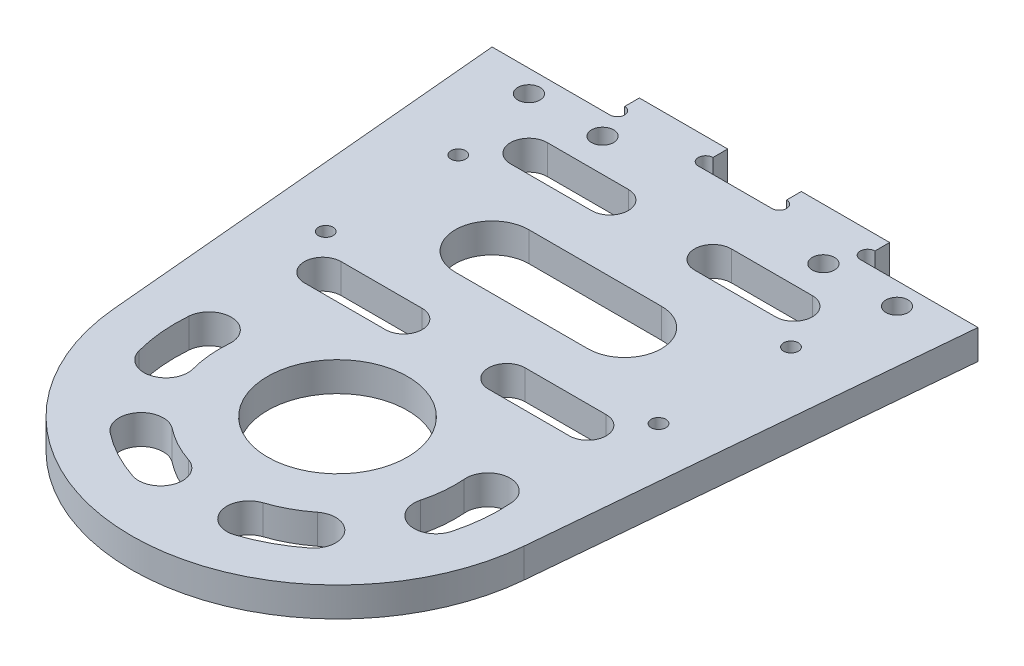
from build123d import *

# Parameters (mm, degrees)
SKETCH1_R           = 28
SKETCH1_R_2         = 13.5
SKETCH1_R_3         = 1.5
BOSS_EXTRUDE1_DEPTH = 4
SKETCH5_R           = 21
CUT_EXTRUDE4_DEPTH  = 10
BOSS_EXTRUDE2_DEPTH = 4
SKETCH7_W           = 12
SKETCH7_H           = 4
BOSS_EXTRUDE3_DEPTH = 4
SKETCH9_R           = 1.5
CUT_EXTRUDE6_DEPTH  = 67.850579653
SKETCH10_R          = 28
BOSS_EXTRUDE4_DEPTH = 4
SKETCH11_R          = 9.5
CUT_EXTRUDE7_DEPTH  = 67.850579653
SKETCH8_R           = 1
CUT_EXTRUDE5_DEPTH  = 67.850579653
CUT_EXTRUDE9_DEPTH  = 67.850579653
CUT_EXTRUDE10_DEPTH = 67.850579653


with BuildPart() as part:
    # Sketch1 → Boss-Extrude1 (new body)
    with BuildSketch(Plane(origin=(0, 0, 0), x_dir=(1, 0, 0), z_dir=(0, 1, 0))):
        with Locations(Location((0, 0, 0), (0, 0, 270))):
            Circle(SKETCH1_R)
        with Locations(Location((0, 0, 0), (0, 0, 270))):
            Circle(SKETCH1_R_2, mode=Mode.SUBTRACT)
        with Locations(Location((0, -17.5, 0), (0, 0, 270))):
            Circle(SKETCH1_R_3, mode=Mode.SUBTRACT)
        with Locations(Location((-17.5, 0, 0), (0, 0, 270))):
            Circle(SKETCH1_R_3, mode=Mode.SUBTRACT)
        with Locations(Location((0, 17.5, 0), (0, 0, 270))):
            Circle(SKETCH1_R_3, mode=Mode.SUBTRACT)
        with Locations(Location((17.5, 0, 0), (0, 0, 270))):
            Circle(SKETCH1_R_3, mode=Mode.SUBTRACT)
        with Locations(Location((0, -25, 0), (0, 0, 270))):
            Circle(SKETCH1_R_3, mode=Mode.SUBTRACT)
        with Locations(Location((-17.67766953, -17.67766953, 0), (0, 0, 270))):
            Circle(SKETCH1_R_3, mode=Mode.SUBTRACT)
        with Locations(Location((-25, 0, 0), (0, 0, 270))):
            Circle(SKETCH1_R_3, mode=Mode.SUBTRACT)
        with Locations(Location((-17.67766953, 17.67766953, 0), (0, 0, 270))):
            Circle(SKETCH1_R_3, mode=Mode.SUBTRACT)
        with Locations(Location((0, 25, 0), (0, 0, 270))):
            Circle(SKETCH1_R_3, mode=Mode.SUBTRACT)
        with Locations(Location((17.67766953, 17.67766953, 0), (0, 0, 270))):
            Circle(SKETCH1_R_3, mode=Mode.SUBTRACT)
        with Locations(Location((25, 0, 0), (0, 0, 270))):
            Circle(SKETCH1_R_3, mode=Mode.SUBTRACT)
        with Locations(Location((17.67766953, -17.67766953, 0), (0, 0, 270))):
            Circle(SKETCH1_R_3, mode=Mode.SUBTRACT)
    extrude(amount=BOSS_EXTRUDE1_DEPTH)

    # Sketch5 → Cut-Extrude4 (cut)
    with BuildSketch(Plane.XZ):
        with Locations(Location((0, 0, 0), (0, 0, 270))):
            Circle(SKETCH5_R)
    extrude(amount=-CUT_EXTRUDE4_DEPTH, mode=Mode.SUBTRACT)



with BuildPart() as body_2:
    # Sketch6 → Boss-Extrude2 (new, through all)
    with BuildSketch(Plane(origin=(0, 4, 0), x_dir=(1, 0, 0), z_dir=(0, 1, 0))):
        with BuildLine():
            ThreePointArc((-27.886099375, -2.522986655), (-20.671763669, 18.885925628), (0, 28))
            Line((0, 28), (0, 54))
            Line((0, 54), (-33, 54))
            Line((-33, 54), (-27.886099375, -2.522986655))
        make_face()
        with BuildLine():
            Line((0, 54), (0, 28))
            ThreePointArc((0, 28), (19.798989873, 19.798989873), (28, 0))
            ThreePointArc((28, 0), (27.97151035, -1.262778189), (27.886099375, -2.522986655))
            Line((27.886099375, -2.522986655), (33, 54))
            Line((33, 54), (0, 54))
        make_face()
    extrude(amount=-BOSS_EXTRUDE2_DEPTH)

    # Sketch7 → Boss-Extrude3 (add, through all)
    with BuildSketch(Plane(origin=(0, 4, 0), x_dir=(1, 0, 0), z_dir=(0, 1, 0))):
        with Locations((-11, 56)):
            Rectangle(SKETCH7_W, SKETCH7_H)
        with Locations((11, 56)):
            Rectangle(SKETCH7_W, SKETCH7_H)
    extrude(amount=-BOSS_EXTRUDE3_DEPTH)

    # Sketch9 → Cut-Extrude6 (cut, through all)
    with BuildSketch(Plane(origin=(0, 4, 0), x_dir=(1, 0, 0), z_dir=(0, 1, 0))):
        with Locations(Location((-25, 51, 0), (0, 0, 270))):
            Circle(SKETCH9_R)
        with Locations(Location((-15, 51, 0), (0, 0, 270))):
            Circle(SKETCH9_R)
        with Locations(Location((25, 51, 0), (0, 0, 270))):
            Circle(SKETCH9_R)
        with Locations(Location((15, 51, 0), (0, 0, 270))):
            Circle(SKETCH9_R)
    extrude(amount=-CUT_EXTRUDE6_DEPTH, mode=Mode.SUBTRACT)


with BuildPart() as part_1:
    add(part.part)

    add(body_2.part)  # Boss-Extrude4 merges body 2
    # Sketch10 → Boss-Extrude4 (add, through all)
    with BuildSketch(Plane(origin=(0, 4, 0), x_dir=(1, 0, 0), z_dir=(0, 1, 0))):
        Circle(SKETCH10_R)
    extrude(amount=-BOSS_EXTRUDE4_DEPTH)

    # Sketch11 → Cut-Extrude7 (cut, through all)
    with BuildSketch(Plane(origin=(0, 4, 0), x_dir=(1, 0, 0), z_dir=(0, 1, 0))):
        with Locations(Location((0, 0, 0), (0, 0, 270))):
            Circle(SKETCH11_R)
    extrude(amount=-CUT_EXTRUDE7_DEPTH, mode=Mode.SUBTRACT)

    # Sketch8 → Cut-Extrude5 (cut, through all)
    with BuildSketch(Plane(origin=(0, 4, 0), x_dir=(1, 0, 0), z_dir=(0, 1, 0))):
        with Locations((-5, 55)):
            Circle(SKETCH8_R)
        with Locations((5, 55)):
            Circle(SKETCH8_R)
        with Locations((-17, 55)):
            Circle(SKETCH8_R)
        with Locations((17, 55)):
            Circle(SKETCH8_R)
        with Locations(Location((-22.6, 39, 0), (0, 0, 270))):
            Circle(SKETCH8_R)
        with Locations(Location((-22.6, 21, 0), (0, 0, 270))):
            Circle(SKETCH8_R)
        with Locations(Location((22.6, 39, 0), (0, 0, 270))):
            Circle(SKETCH8_R)
        with Locations(Location((22.6, 21, 0), (0, 0, 270))):
            Circle(SKETCH8_R)
    extrude(amount=-CUT_EXTRUDE5_DEPTH, mode=Mode.SUBTRACT)

    # Sketch13 → Cut-Extrude9 (cut, through all)
    with BuildSketch(Plane(origin=(0, 4, 0), x_dir=(1, 0, 0), z_dir=(0, 1, 0))):
        with BuildLine():
            Line((-18, 18.5), (-7, 18.5))
            ThreePointArc((-7, 18.5), (-4.5, 16), (-7, 13.5))
            Line((-7, 13.5), (-18, 13.5))
            ThreePointArc((-18, 13.5), (-20.5, 16), (-18, 18.5))
        make_face()
        with BuildLine():
            Line((-18, 46.5), (-7, 46.5))
            ThreePointArc((-7, 46.5), (-4.5, 44), (-7, 41.5))
            Line((-7, 41.5), (-18, 41.5))
            ThreePointArc((-18, 41.5), (-20.5, 44), (-18, 46.5))
        make_face()
        with BuildLine():
            Line((18, 18.5), (7, 18.5))
            ThreePointArc((7, 18.5), (4.5, 16), (7, 13.5))
            Line((7, 13.5), (18, 13.5))
            ThreePointArc((18, 13.5), (20.5, 16), (18, 18.5))
        make_face()
        with BuildLine():
            Line((18, 46.5), (7, 46.5))
            ThreePointArc((7, 46.5), (4.5, 44), (7, 41.5))
            Line((7, 41.5), (18, 41.5))
            ThreePointArc((18, 41.5), (20.5, 44), (18, 46.5))
        make_face()
        with BuildLine():
            ThreePointArc((-13.562636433, -17.322092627), (-10.407666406, -19.382478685), (-6.947368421, -20.874244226))
            ThreePointArc((-6.947368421, -20.874244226), (-3.153512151, -18.975124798), (-5.052631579, -15.181268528))
            ThreePointArc((-5.052631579, -15.181268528), (-7.569211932, -14.096348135), (-9.863735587, -12.597885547))
            ThreePointArc((-9.863735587, -12.597885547), (-14.07528955, -13.110538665), (-13.562636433, -17.322092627))
        make_face()
        with BuildLine():
            ThreePointArc((13.562636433, -17.322092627), (10.407666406, -19.382478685), (6.947368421, -20.874244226))
            ThreePointArc((6.947368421, -20.874244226), (3.153512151, -18.975124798), (5.052631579, -15.181268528))
            ThreePointArc((5.052631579, -15.181268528), (7.569211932, -14.096348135), (9.863735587, -12.597885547))
            ThreePointArc((9.863735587, -12.597885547), (14.07528955, -13.110538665), (13.562636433, -17.322092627))
        make_face()
        with BuildLine():
            ThreePointArc((-21.931333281, 1.736842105), (-21.906028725, -2.031232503), (-21.23807069, -5.739717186))
            ThreePointArc((-21.23807069, -5.739717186), (-17.559281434, -7.853129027), (-15.445869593, -4.174339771))
            ThreePointArc((-15.445869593, -4.174339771), (-15.931657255, -1.477260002), (-15.950060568, 1.263157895))
            ThreePointArc((-15.950060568, 1.263157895), (-18.70385482, 4.490636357), (-21.931333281, 1.736842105))
        make_face()
        with BuildLine():
            ThreePointArc((21.931333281, 1.736842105), (21.906028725, -2.031232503), (21.23807069, -5.739717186))
            ThreePointArc((21.23807069, -5.739717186), (17.559281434, -7.853129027), (15.445869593, -4.174339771))
            ThreePointArc((15.445869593, -4.174339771), (15.931657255, -1.477260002), (15.950060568, 1.263157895))
            ThreePointArc((15.950060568, 1.263157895), (18.70385482, 4.490636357), (21.931333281, 1.736842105))
        make_face()
    extrude(amount=-CUT_EXTRUDE9_DEPTH, mode=Mode.SUBTRACT)

    # Sketch14 → Cut-Extrude10 (cut, through all)
    with BuildSketch(Plane(origin=(0, 4, 0), x_dir=(1, 0, 0), z_dir=(0, 1, 0))):
        with BuildLine():
            Line((-9, 35), (9, 35))
            ThreePointArc((9, 35), (14, 30), (9, 25))
            Line((9, 25), (-9, 25))
            ThreePointArc((-9, 25), (-14, 30), (-9, 35))
        make_face()
    extrude(amount=-CUT_EXTRUDE10_DEPTH, mode=Mode.SUBTRACT)


solid = part_1.part
